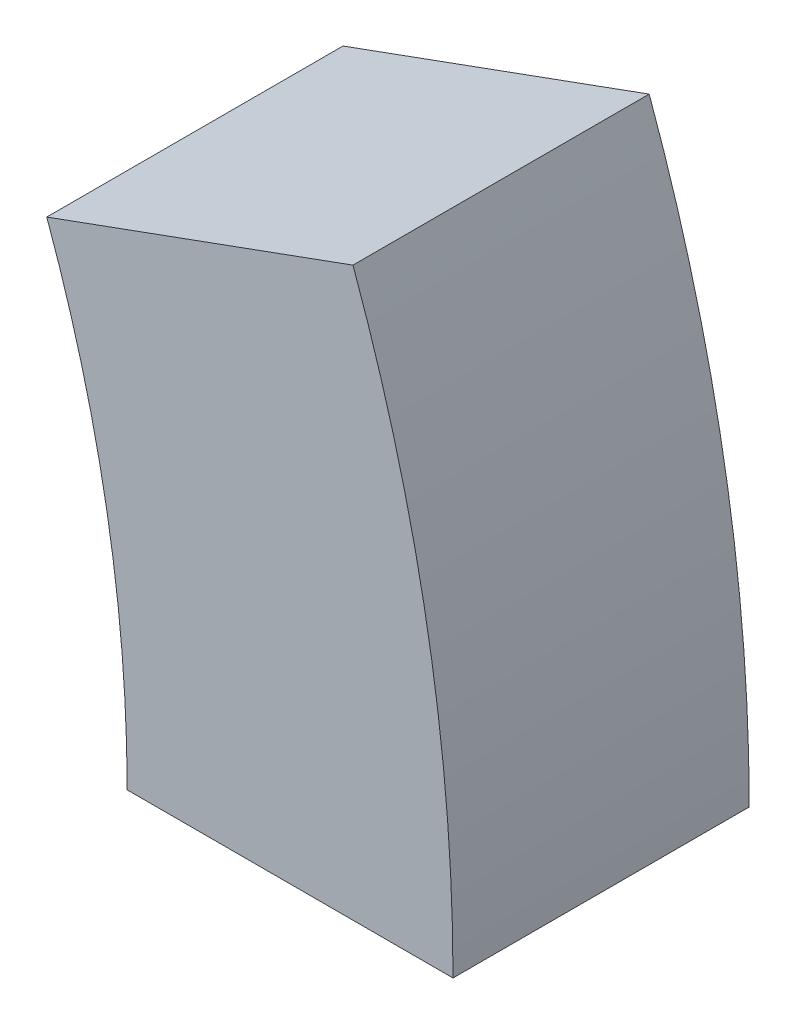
from build123d import *

# Parameters (mm, degrees)
EXTRUSION1_DEPTH = 20


with BuildPart() as part:
    # Esquisse1 → Extrusion1 (new body)
    with BuildSketch(Plane.XY):
        with BuildLine():
            Line((90, 0), (112, 0))
            ThreePointArc((112, 0), (110.298468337, 19.448595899), (105.245573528, 38.306256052))
            Line((105.245573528, 38.306256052), (84.572335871, 30.781812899))
            ThreePointArc((84.572335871, 30.781812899), (88.632697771, 15.62833599), (90, 0))
        make_face()
    extrude(amount=EXTRUSION1_DEPTH)


solid = part.part
